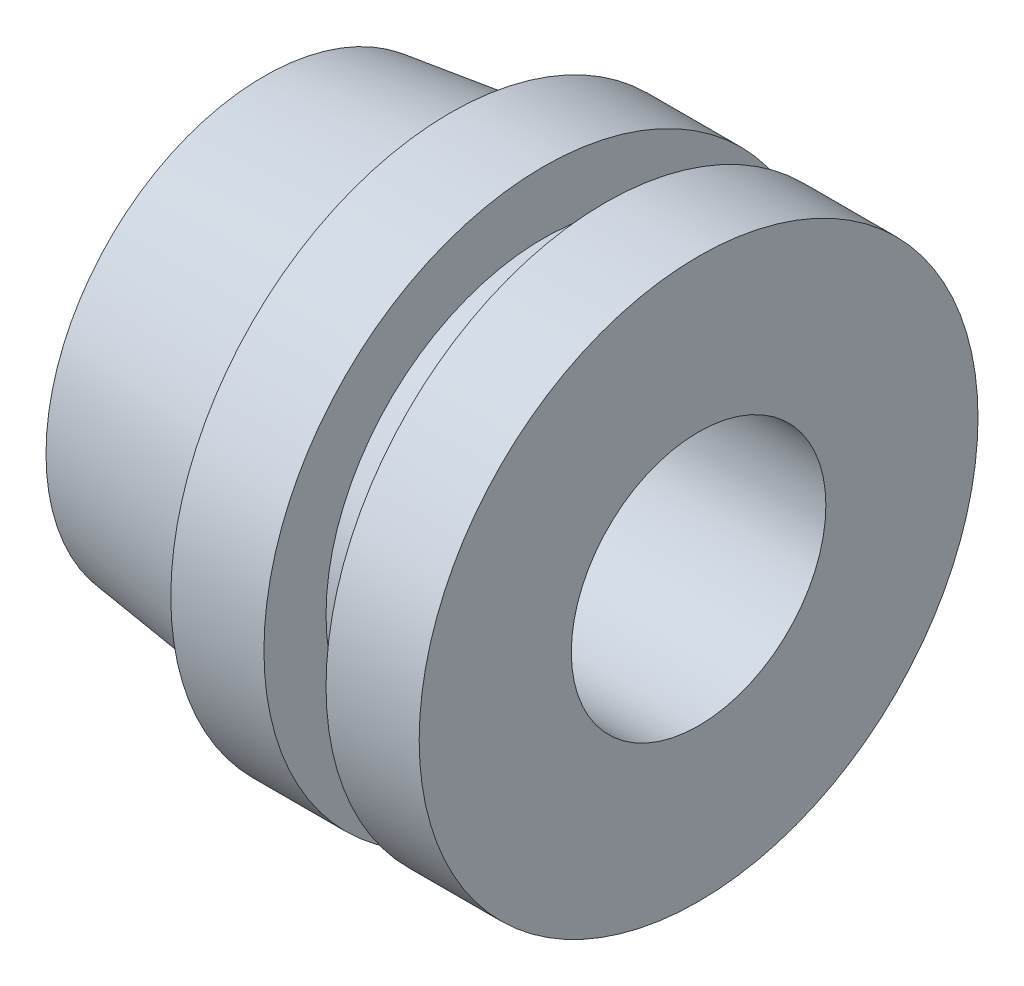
ISO-10303-21;
HEADER;
FILE_DESCRIPTION(('STEP AP214'),'2;1');
FILE_NAME('part.step','',(''),(''),'','','');
FILE_SCHEMA(('AUTOMOTIVE_DESIGN { 1 0 10303 214 1 1 1 1 }'));
ENDSEC;
DATA;
#1=APPLICATION_CONTEXT('core data for automotive mechanical design processes');
#2=APPLICATION_PROTOCOL_DEFINITION('international standard','automotive_design',2000,#1);
#3=PRODUCT_CONTEXT('',#1,'mechanical');
#4=PRODUCT('Part','Part','',(#3));
#5=PRODUCT_RELATED_PRODUCT_CATEGORY('part','',(#4));
#6=PRODUCT_DEFINITION_FORMATION('','',#4);
#7=PRODUCT_DEFINITION_CONTEXT('part definition',#1,'design');
#8=PRODUCT_DEFINITION('design','',#6,#7);
#9=PRODUCT_DEFINITION_SHAPE('','',#8);
#10=(LENGTH_UNIT() NAMED_UNIT(*) SI_UNIT(.MILLI.,.METRE.));
#11=(NAMED_UNIT(*) PLANE_ANGLE_UNIT() SI_UNIT($,.RADIAN.));
#12=(NAMED_UNIT(*) SI_UNIT($,.STERADIAN.) SOLID_ANGLE_UNIT());
#13=UNCERTAINTY_MEASURE_WITH_UNIT(LENGTH_MEASURE(1.E-05),#10,'distance_accuracy_value','');
#14=(GEOMETRIC_REPRESENTATION_CONTEXT(3) GLOBAL_UNCERTAINTY_ASSIGNED_CONTEXT((#13)) GLOBAL_UNIT_ASSIGNED_CONTEXT((#10,
#11,#12)) REPRESENTATION_CONTEXT('',''));
#15=CARTESIAN_POINT('',(0.,0.,0.));
#16=DIRECTION('',(0.,0.,1.));
#17=DIRECTION('',(1.,0.,0.));
#18=AXIS2_PLACEMENT_3D('',#15,#16,#17);
#19=CARTESIAN_POINT('',(0.,-2.25,0.));
#20=DIRECTION('',(1.,0.,0.));
#21=DIRECTION('',(0.,0.,-1.));
#22=AXIS2_PLACEMENT_3D('',#19,#20,#21);
#23=PLANE('',#22);
#24=CARTESIAN_POINT('',(0.,0.,0.));
#25=DIRECTION('',(1.,0.,0.));
#26=DIRECTION('',(0.,0.,-1.));
#27=AXIS2_PLACEMENT_3D('',#24,#25,#26);
#28=CIRCLE('',#27,1.025);
#29=CARTESIAN_POINT('',(0.,0.,-1.025));
#30=VERTEX_POINT('',#29);
#31=EDGE_CURVE('E66',#30,#30,#28,.T.);
#32=ORIENTED_EDGE('',*,*,#31,.F.);
#33=EDGE_LOOP('',(#32));
#34=FACE_BOUND('',#33,.T.);
#35=CARTESIAN_POINT('',(0.,0.,0.));
#36=DIRECTION('',(-1.,0.,0.));
#37=DIRECTION('',(0.,0.,1.));
#38=AXIS2_PLACEMENT_3D('',#35,#36,#37);
#39=CIRCLE('',#38,2.25);
#40=CARTESIAN_POINT('',(0.,0.,2.25));
#41=VERTEX_POINT('',#40);
#42=EDGE_CURVE('E60',#41,#41,#39,.T.);
#43=ORIENTED_EDGE('',*,*,#42,.F.);
#44=EDGE_LOOP('',(#43));
#45=FACE_BOUND('',#44,.T.);
#46=ADVANCED_FACE('F32',(#34,#45),#23,.T.);
#47=CARTESIAN_POINT('',(-3.5,-1.,0.));
#48=DIRECTION('',(-1.,0.,0.));
#49=DIRECTION('',(0.,0.,1.));
#50=AXIS2_PLACEMENT_3D('',#47,#48,#49);
#51=PLANE('',#50);
#52=CARTESIAN_POINT('',(-3.5,0.,0.));
#53=DIRECTION('',(1.,0.,0.));
#54=DIRECTION('',(0.,0.,-1.));
#55=AXIS2_PLACEMENT_3D('',#52,#53,#54);
#56=CIRCLE('',#55,1.025);
#57=CARTESIAN_POINT('',(-3.5,0.,-1.025));
#58=VERTEX_POINT('',#57);
#59=EDGE_CURVE('E63',#58,#58,#56,.T.);
#60=ORIENTED_EDGE('',*,*,#59,.T.);
#61=EDGE_LOOP('',(#60));
#62=FACE_BOUND('',#61,.T.);
#63=CARTESIAN_POINT('',(-3.5,0.,0.));
#64=DIRECTION('',(-1.,0.,0.));
#65=DIRECTION('',(0.,0.,1.));
#66=AXIS2_PLACEMENT_3D('',#63,#64,#65);
#67=CIRCLE('',#66,1.755);
#68=CARTESIAN_POINT('',(-3.5,0.,1.755));
#69=VERTEX_POINT('',#68);
#70=EDGE_CURVE('E10',#69,#69,#67,.T.);
#71=ORIENTED_EDGE('',*,*,#70,.T.);
#72=EDGE_LOOP('',(#71));
#73=FACE_BOUND('',#72,.T.);
#74=ADVANCED_FACE('F74',(#62,#73),#51,.T.);
#75=CARTESIAN_POINT('',(-3.5,0.,0.));
#76=DIRECTION('',(1.,0.,0.));
#77=DIRECTION('',(0.,0.,-1.));
#78=AXIS2_PLACEMENT_3D('',#75,#76,#77);
#79=CONICAL_SURFACE('',#78,1.755,0.129275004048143);
#80=CARTESIAN_POINT('',(-2.,0.,0.));
#81=DIRECTION('',(-1.,0.,0.));
#82=DIRECTION('',(0.,0.,1.));
#83=AXIS2_PLACEMENT_3D('',#80,#81,#82);
#84=CIRCLE('',#83,1.95);
#85=CARTESIAN_POINT('',(-2.,0.,1.95));
#86=VERTEX_POINT('',#85);
#87=EDGE_CURVE('E38',#86,#86,#84,.T.);
#88=ORIENTED_EDGE('',*,*,#87,.T.);
#89=EDGE_LOOP('',(#88));
#90=FACE_BOUND('',#89,.T.);
#91=ORIENTED_EDGE('',*,*,#70,.F.);
#92=EDGE_LOOP('',(#91));
#93=FACE_BOUND('',#92,.T.);
#94=ADVANCED_FACE('F110',(#90,#93),#79,.T.);
#95=CARTESIAN_POINT('',(-2.,-1.95,0.));
#96=DIRECTION('',(-1.,0.,0.));
#97=DIRECTION('',(0.,0.,1.));
#98=AXIS2_PLACEMENT_3D('',#95,#96,#97);
#99=PLANE('',#98);
#100=CARTESIAN_POINT('',(-2.,0.,0.));
#101=DIRECTION('',(-1.,0.,0.));
#102=DIRECTION('',(0.,0.,1.));
#103=AXIS2_PLACEMENT_3D('',#100,#101,#102);
#104=CIRCLE('',#103,2.25);
#105=CARTESIAN_POINT('',(-2.,0.,2.25));
#106=VERTEX_POINT('',#105);
#107=EDGE_CURVE('E42',#106,#106,#104,.T.);
#108=ORIENTED_EDGE('',*,*,#107,.T.);
#109=EDGE_LOOP('',(#108));
#110=FACE_BOUND('',#109,.T.);
#111=ORIENTED_EDGE('',*,*,#87,.F.);
#112=EDGE_LOOP('',(#111));
#113=FACE_BOUND('',#112,.T.);
#114=ADVANCED_FACE('F104',(#110,#113),#99,.T.);
#115=CARTESIAN_POINT('',(-109.06150458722,0.,0.));
#116=DIRECTION('',(-1.,0.,0.));
#117=DIRECTION('',(0.,0.,1.));
#118=AXIS2_PLACEMENT_3D('',#115,#116,#117);
#119=CYLINDRICAL_SURFACE('',#118,2.25);
#120=CARTESIAN_POINT('',(-1.25,0.,0.));
#121=DIRECTION('',(-1.,0.,0.));
#122=DIRECTION('',(0.,0.,1.));
#123=AXIS2_PLACEMENT_3D('',#120,#121,#122);
#124=CIRCLE('',#123,2.25);
#125=CARTESIAN_POINT('',(-1.25,0.,2.25));
#126=VERTEX_POINT('',#125);
#127=EDGE_CURVE('E46',#126,#126,#124,.T.);
#128=ORIENTED_EDGE('',*,*,#127,.T.);
#129=EDGE_LOOP('',(#128));
#130=FACE_BOUND('',#129,.T.);
#131=ORIENTED_EDGE('',*,*,#107,.F.);
#132=EDGE_LOOP('',(#131));
#133=FACE_BOUND('',#132,.T.);
#134=ADVANCED_FACE('F98',(#130,#133),#119,.T.);
#135=CARTESIAN_POINT('',(-1.25,-2.25,0.));
#136=DIRECTION('',(1.,0.,0.));
#137=DIRECTION('',(0.,0.,-1.));
#138=AXIS2_PLACEMENT_3D('',#135,#136,#137);
#139=PLANE('',#138);
#140=CARTESIAN_POINT('',(-1.25,0.,0.));
#141=DIRECTION('',(-1.,0.,0.));
#142=DIRECTION('',(0.,0.,1.));
#143=AXIS2_PLACEMENT_3D('',#140,#141,#142);
#144=CIRCLE('',#143,1.75);
#145=CARTESIAN_POINT('',(-1.25,0.,1.75));
#146=VERTEX_POINT('',#145);
#147=EDGE_CURVE('E51',#146,#146,#144,.T.);
#148=ORIENTED_EDGE('',*,*,#147,.T.);
#149=EDGE_LOOP('',(#148));
#150=FACE_BOUND('',#149,.T.);
#151=ORIENTED_EDGE('',*,*,#127,.F.);
#152=EDGE_LOOP('',(#151));
#153=FACE_BOUND('',#152,.T.);
#154=ADVANCED_FACE('F92',(#150,#153),#139,.T.);
#155=CARTESIAN_POINT('',(-109.06150458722,0.,0.));
#156=DIRECTION('',(-1.,0.,0.));
#157=DIRECTION('',(0.,0.,1.));
#158=AXIS2_PLACEMENT_3D('',#155,#156,#157);
#159=CYLINDRICAL_SURFACE('',#158,1.75);
#160=CARTESIAN_POINT('',(-0.750000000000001,0.,0.));
#161=DIRECTION('',(-1.,0.,0.));
#162=DIRECTION('',(0.,0.,1.));
#163=AXIS2_PLACEMENT_3D('',#160,#161,#162);
#164=CIRCLE('',#163,1.75);
#165=CARTESIAN_POINT('',(-0.750000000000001,0.,1.75));
#166=VERTEX_POINT('',#165);
#167=EDGE_CURVE('E54',#166,#166,#164,.T.);
#168=ORIENTED_EDGE('',*,*,#167,.T.);
#169=EDGE_LOOP('',(#168));
#170=FACE_BOUND('',#169,.T.);
#171=ORIENTED_EDGE('',*,*,#147,.F.);
#172=EDGE_LOOP('',(#171));
#173=FACE_BOUND('',#172,.T.);
#174=ADVANCED_FACE('F86',(#170,#173),#159,.T.);
#175=CARTESIAN_POINT('',(-0.75,-1.75,0.));
#176=DIRECTION('',(-1.,0.,0.));
#177=DIRECTION('',(0.,0.,1.));
#178=AXIS2_PLACEMENT_3D('',#175,#176,#177);
#179=PLANE('',#178);
#180=CARTESIAN_POINT('',(-0.750000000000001,0.,0.));
#181=DIRECTION('',(-1.,0.,0.));
#182=DIRECTION('',(0.,0.,1.));
#183=AXIS2_PLACEMENT_3D('',#180,#181,#182);
#184=CIRCLE('',#183,2.25);
#185=CARTESIAN_POINT('',(-0.750000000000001,0.,2.25));
#186=VERTEX_POINT('',#185);
#187=EDGE_CURVE('E57',#186,#186,#184,.T.);
#188=ORIENTED_EDGE('',*,*,#187,.T.);
#189=EDGE_LOOP('',(#188));
#190=FACE_BOUND('',#189,.T.);
#191=ORIENTED_EDGE('',*,*,#167,.F.);
#192=EDGE_LOOP('',(#191));
#193=FACE_BOUND('',#192,.T.);
#194=ADVANCED_FACE('F80',(#190,#193),#179,.T.);
#195=CARTESIAN_POINT('',(-109.06150458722,0.,0.));
#196=DIRECTION('',(-1.,0.,0.));
#197=DIRECTION('',(0.,0.,1.));
#198=AXIS2_PLACEMENT_3D('',#195,#196,#197);
#199=CYLINDRICAL_SURFACE('',#198,2.25);
#200=ORIENTED_EDGE('',*,*,#42,.T.);
#201=EDGE_LOOP('',(#200));
#202=FACE_BOUND('',#201,.T.);
#203=ORIENTED_EDGE('',*,*,#187,.F.);
#204=EDGE_LOOP('',(#203));
#205=FACE_BOUND('',#204,.T.);
#206=ADVANCED_FACE('F77',(#202,#205),#199,.T.);
#207=CARTESIAN_POINT('',(0.,0.,0.));
#208=DIRECTION('',(1.,0.,0.));
#209=DIRECTION('',(0.,0.,-1.));
#210=AXIS2_PLACEMENT_3D('',#207,#208,#209);
#211=CYLINDRICAL_SURFACE('',#210,1.025);
#212=ORIENTED_EDGE('',*,*,#59,.F.);
#213=EDGE_LOOP('',(#212));
#214=FACE_BOUND('',#213,.T.);
#215=ORIENTED_EDGE('',*,*,#31,.T.);
#216=EDGE_LOOP('',(#215));
#217=FACE_BOUND('',#216,.T.);
#218=ADVANCED_FACE('F70',(#214,#217),#211,.F.);
#219=CLOSED_SHELL('',(#46,#74,#94,#114,#134,#154,#174,#194,#206,#218));
#220=MANIFOLD_SOLID_BREP('B2',#219);
#221=ADVANCED_BREP_SHAPE_REPRESENTATION('',(#18,#220),#14);
#222=SHAPE_DEFINITION_REPRESENTATION(#9,#221);
ENDSEC;
END-ISO-10303-21;
